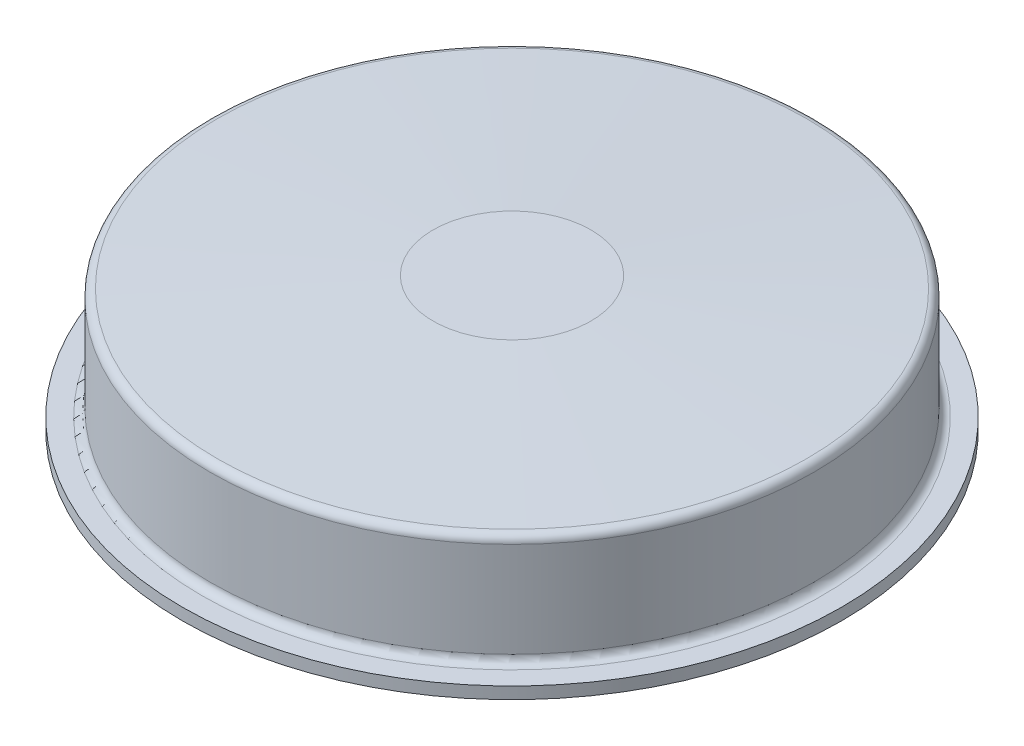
from build123d import *


with BuildPart() as part:
    # Skizze1 → Rotation1 (revolve)
    with BuildSketch(Plane.XY, mode=Mode.PRIVATE) as rotation1_sk:
        with BuildLine():
            Line((600, 1187.5), (673.5, 1187.5))
            Line((673.5, 1187.5), (673.5, 1159.5))
            Line((673.5, 1159.5), (683.5, 1159.5))
            Line((683.5, 1159.5), (683.5, 1162.5))
            Line((683.5, 1162.5), (678.5, 1162.5))
            ThreePointArc((678.5, 1162.5), (677.085786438, 1163.085786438), (676.5, 1164.5))
            Line((676.5, 1164.5), (676.5, 1188.603377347))
            ThreePointArc((676.5, 1188.603377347), (675.951222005, 1189.979587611), (674.606045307, 1190.600563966))
            Line((674.606045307, 1190.600563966), (620, 1193.5))
            Line((620, 1193.5), (600, 1193.5))
            Line((600, 1193.5), (600, 1187.5))
        make_face()
    revolve(rotation1_sk.sketch.rotate(Axis((600, 1187.5, 0), (0, -1, 0)), 90), axis=Axis((600, 1187.5, 0), (0, -1, 0)))


solid = part.part
